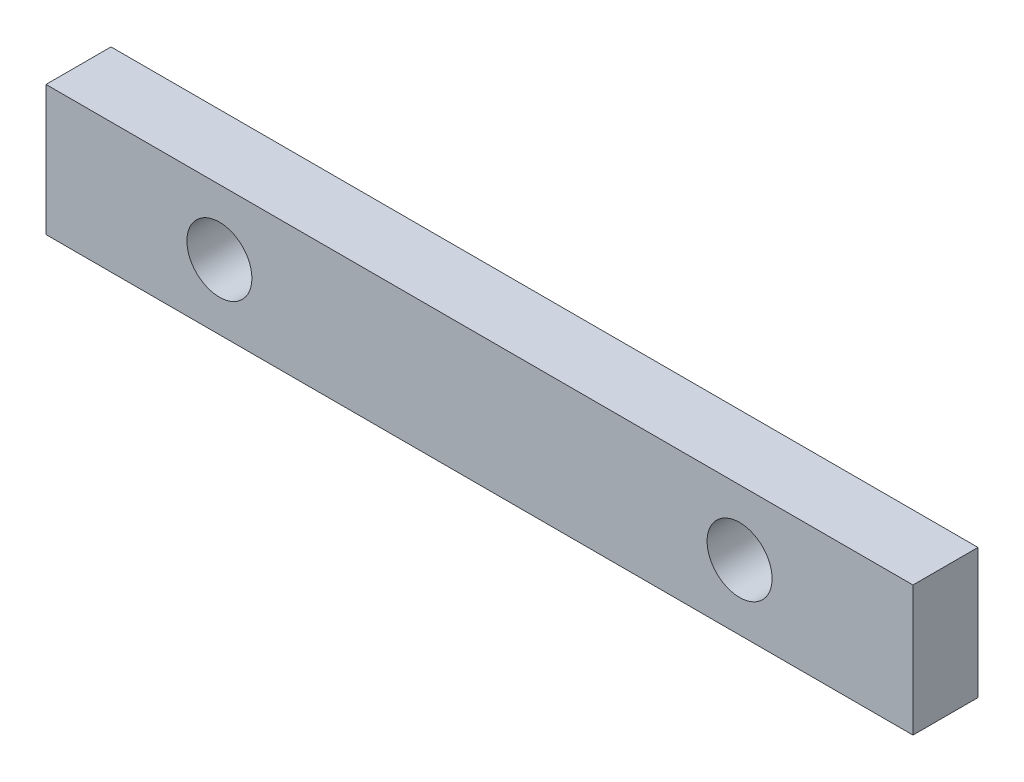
ISO-10303-21;
HEADER;
FILE_DESCRIPTION(('STEP AP214'),'2;1');
FILE_NAME('part.step','',(''),(''),'','','');
FILE_SCHEMA(('AUTOMOTIVE_DESIGN { 1 0 10303 214 1 1 1 1 }'));
ENDSEC;
DATA;
#1=APPLICATION_CONTEXT('core data for automotive mechanical design processes');
#2=APPLICATION_PROTOCOL_DEFINITION('international standard','automotive_design',2000,#1);
#3=PRODUCT_CONTEXT('',#1,'mechanical');
#4=PRODUCT('Part','Part','',(#3));
#5=PRODUCT_RELATED_PRODUCT_CATEGORY('part','',(#4));
#6=PRODUCT_DEFINITION_FORMATION('','',#4);
#7=PRODUCT_DEFINITION_CONTEXT('part definition',#1,'design');
#8=PRODUCT_DEFINITION('design','',#6,#7);
#9=PRODUCT_DEFINITION_SHAPE('','',#8);
#10=(LENGTH_UNIT() NAMED_UNIT(*) SI_UNIT(.MILLI.,.METRE.));
#11=(NAMED_UNIT(*) PLANE_ANGLE_UNIT() SI_UNIT($,.RADIAN.));
#12=(NAMED_UNIT(*) SI_UNIT($,.STERADIAN.) SOLID_ANGLE_UNIT());
#13=UNCERTAINTY_MEASURE_WITH_UNIT(LENGTH_MEASURE(1.E-05),#10,'distance_accuracy_value','');
#14=(GEOMETRIC_REPRESENTATION_CONTEXT(3) GLOBAL_UNCERTAINTY_ASSIGNED_CONTEXT((#13)) GLOBAL_UNIT_ASSIGNED_CONTEXT((#10,
#11,#12)) REPRESENTATION_CONTEXT('',''));
#15=CARTESIAN_POINT('',(0.,0.,0.));
#16=DIRECTION('',(0.,0.,1.));
#17=DIRECTION('',(1.,0.,0.));
#18=AXIS2_PLACEMENT_3D('',#15,#16,#17);
#19=CARTESIAN_POINT('',(0.,0.,3.));
#20=DIRECTION('',(1.,0.,0.));
#21=DIRECTION('',(0.,0.,-1.));
#22=AXIS2_PLACEMENT_3D('',#19,#20,#21);
#23=PLANE('',#22);
#24=DIRECTION('',(0.,-1.,0.));
#25=VECTOR('',#24,1.);
#26=CARTESIAN_POINT('',(0.,0.,0.));
#27=LINE('',#26,#25);
#28=CARTESIAN_POINT('',(0.,6.,0.));
#29=VERTEX_POINT('',#28);
#30=CARTESIAN_POINT('',(0.,0.,0.));
#31=VERTEX_POINT('',#30);
#32=EDGE_CURVE('E70',#29,#31,#27,.T.);
#33=ORIENTED_EDGE('',*,*,#32,.T.);
#34=DIRECTION('',(0.,0.,-1.));
#35=VECTOR('',#34,1.);
#36=CARTESIAN_POINT('',(0.,0.,3.));
#37=LINE('',#36,#35);
#38=CARTESIAN_POINT('',(0.,0.,3.));
#39=VERTEX_POINT('',#38);
#40=EDGE_CURVE('E11',#39,#31,#37,.T.);
#41=ORIENTED_EDGE('',*,*,#40,.F.);
#42=DIRECTION('',(0.,-1.,0.));
#43=VECTOR('',#42,1.);
#44=CARTESIAN_POINT('',(0.,0.,3.));
#45=LINE('',#44,#43);
#46=CARTESIAN_POINT('',(0.,6.,3.));
#47=VERTEX_POINT('',#46);
#48=EDGE_CURVE('E93',#47,#39,#45,.T.);
#49=ORIENTED_EDGE('',*,*,#48,.F.);
#50=DIRECTION('',(0.,0.,-1.));
#51=VECTOR('',#50,1.);
#52=CARTESIAN_POINT('',(0.,6.,3.));
#53=LINE('',#52,#51);
#54=EDGE_CURVE('E82',#47,#29,#53,.T.);
#55=ORIENTED_EDGE('',*,*,#54,.T.);
#56=EDGE_LOOP('',(#33,#41,#49,#55));
#57=FACE_BOUND('',#56,.T.);
#58=ADVANCED_FACE('F26',(#57),#23,.F.);
#59=CARTESIAN_POINT('',(0.,0.,3.));
#60=DIRECTION('',(0.,1.,0.));
#61=DIRECTION('',(0.,0.,1.));
#62=AXIS2_PLACEMENT_3D('',#59,#60,#61);
#63=PLANE('',#62);
#64=DIRECTION('',(1.,0.,0.));
#65=VECTOR('',#64,1.);
#66=CARTESIAN_POINT('',(0.,0.,0.));
#67=LINE('',#66,#65);
#68=CARTESIAN_POINT('',(40.,0.,0.));
#69=VERTEX_POINT('',#68);
#70=EDGE_CURVE('E66',#31,#69,#67,.T.);
#71=ORIENTED_EDGE('',*,*,#70,.T.);
#72=DIRECTION('',(0.,0.,-1.));
#73=VECTOR('',#72,1.);
#74=CARTESIAN_POINT('',(40.,0.,3.));
#75=LINE('',#74,#73);
#76=CARTESIAN_POINT('',(40.,0.,3.));
#77=VERTEX_POINT('',#76);
#78=EDGE_CURVE('E33',#77,#69,#75,.T.);
#79=ORIENTED_EDGE('',*,*,#78,.F.);
#80=DIRECTION('',(1.,0.,0.));
#81=VECTOR('',#80,1.);
#82=CARTESIAN_POINT('',(0.,0.,3.));
#83=LINE('',#82,#81);
#84=EDGE_CURVE('E78',#39,#77,#83,.T.);
#85=ORIENTED_EDGE('',*,*,#84,.F.);
#86=ORIENTED_EDGE('',*,*,#40,.T.);
#87=EDGE_LOOP('',(#71,#79,#85,#86));
#88=FACE_BOUND('',#87,.T.);
#89=ADVANCED_FACE('F77',(#88),#63,.F.);
#90=CARTESIAN_POINT('',(40.,0.,3.));
#91=DIRECTION('',(-1.,0.,0.));
#92=DIRECTION('',(0.,0.,1.));
#93=AXIS2_PLACEMENT_3D('',#90,#91,#92);
#94=PLANE('',#93);
#95=DIRECTION('',(0.,1.,0.));
#96=VECTOR('',#95,1.);
#97=CARTESIAN_POINT('',(40.,0.,0.));
#98=LINE('',#97,#96);
#99=CARTESIAN_POINT('',(40.,6.,0.));
#100=VERTEX_POINT('',#99);
#101=EDGE_CURVE('E71',#69,#100,#98,.T.);
#102=ORIENTED_EDGE('',*,*,#101,.T.);
#103=DIRECTION('',(0.,0.,-1.));
#104=VECTOR('',#103,1.);
#105=CARTESIAN_POINT('',(40.,6.,3.));
#106=LINE('',#105,#104);
#107=CARTESIAN_POINT('',(40.,6.,3.));
#108=VERTEX_POINT('',#107);
#109=EDGE_CURVE('E99',#108,#100,#106,.T.);
#110=ORIENTED_EDGE('',*,*,#109,.F.);
#111=DIRECTION('',(0.,1.,0.));
#112=VECTOR('',#111,1.);
#113=CARTESIAN_POINT('',(40.,0.,3.));
#114=LINE('',#113,#112);
#115=EDGE_CURVE('E45',#77,#108,#114,.T.);
#116=ORIENTED_EDGE('',*,*,#115,.F.);
#117=ORIENTED_EDGE('',*,*,#78,.T.);
#118=EDGE_LOOP('',(#102,#110,#116,#117));
#119=FACE_BOUND('',#118,.T.);
#120=ADVANCED_FACE('F102',(#119),#94,.F.);
#121=CARTESIAN_POINT('',(0.,6.,3.));
#122=DIRECTION('',(0.,-1.,0.));
#123=DIRECTION('',(0.,0.,-1.));
#124=AXIS2_PLACEMENT_3D('',#121,#122,#123);
#125=PLANE('',#124);
#126=DIRECTION('',(-1.,0.,0.));
#127=VECTOR('',#126,1.);
#128=CARTESIAN_POINT('',(0.,6.,0.));
#129=LINE('',#128,#127);
#130=EDGE_CURVE('E91',#100,#29,#129,.T.);
#131=ORIENTED_EDGE('',*,*,#130,.T.);
#132=ORIENTED_EDGE('',*,*,#54,.F.);
#133=DIRECTION('',(-1.,0.,0.));
#134=VECTOR('',#133,1.);
#135=CARTESIAN_POINT('',(0.,6.,3.));
#136=LINE('',#135,#134);
#137=EDGE_CURVE('E40',#108,#47,#136,.T.);
#138=ORIENTED_EDGE('',*,*,#137,.F.);
#139=ORIENTED_EDGE('',*,*,#109,.T.);
#140=EDGE_LOOP('',(#131,#132,#138,#139));
#141=FACE_BOUND('',#140,.T.);
#142=ADVANCED_FACE('F104',(#141),#125,.F.);
#143=CARTESIAN_POINT('',(0.,6.,3.));
#144=DIRECTION('',(0.,0.,-1.));
#145=DIRECTION('',(-1.,0.,0.));
#146=AXIS2_PLACEMENT_3D('',#143,#144,#145);
#147=PLANE('',#146);
#148=CARTESIAN_POINT('',(32.,3.,3.));
#149=DIRECTION('',(0.,0.,1.));
#150=DIRECTION('',(1.,0.,0.));
#151=AXIS2_PLACEMENT_3D('',#148,#149,#150);
#152=CIRCLE('',#151,1.5);
#153=CARTESIAN_POINT('',(33.5,3.,3.));
#154=VERTEX_POINT('',#153);
#155=EDGE_CURVE('E161',#154,#154,#152,.T.);
#156=ORIENTED_EDGE('',*,*,#155,.F.);
#157=EDGE_LOOP('',(#156));
#158=FACE_BOUND('',#157,.T.);
#159=CARTESIAN_POINT('',(8.,3.,3.));
#160=DIRECTION('',(0.,0.,1.));
#161=DIRECTION('',(1.,0.,0.));
#162=AXIS2_PLACEMENT_3D('',#159,#160,#161);
#163=CIRCLE('',#162,1.5);
#164=CARTESIAN_POINT('',(9.5,3.,3.));
#165=VERTEX_POINT('',#164);
#166=EDGE_CURVE('E86',#165,#165,#163,.T.);
#167=ORIENTED_EDGE('',*,*,#166,.F.);
#168=EDGE_LOOP('',(#167));
#169=FACE_BOUND('',#168,.T.);
#170=ORIENTED_EDGE('',*,*,#48,.T.);
#171=ORIENTED_EDGE('',*,*,#84,.T.);
#172=ORIENTED_EDGE('',*,*,#115,.T.);
#173=ORIENTED_EDGE('',*,*,#137,.T.);
#174=EDGE_LOOP('',(#170,#171,#172,#173));
#175=FACE_BOUND('',#174,.T.);
#176=ADVANCED_FACE('F105',(#158,#169,#175),#147,.F.);
#177=CARTESIAN_POINT('',(0.,6.,0.));
#178=DIRECTION('',(0.,0.,-1.));
#179=DIRECTION('',(-1.,0.,0.));
#180=AXIS2_PLACEMENT_3D('',#177,#178,#179);
#181=PLANE('',#180);
#182=CARTESIAN_POINT('',(32.,3.,0.));
#183=DIRECTION('',(0.,0.,1.));
#184=DIRECTION('',(1.,0.,0.));
#185=AXIS2_PLACEMENT_3D('',#182,#183,#184);
#186=CIRCLE('',#185,1.5);
#187=CARTESIAN_POINT('',(33.5,3.,0.));
#188=VERTEX_POINT('',#187);
#189=EDGE_CURVE('E159',#188,#188,#186,.T.);
#190=ORIENTED_EDGE('',*,*,#189,.T.);
#191=EDGE_LOOP('',(#190));
#192=FACE_BOUND('',#191,.T.);
#193=CARTESIAN_POINT('',(8.,3.,0.));
#194=DIRECTION('',(0.,0.,1.));
#195=DIRECTION('',(1.,0.,0.));
#196=AXIS2_PLACEMENT_3D('',#193,#194,#195);
#197=CIRCLE('',#196,1.5);
#198=CARTESIAN_POINT('',(9.5,3.,0.));
#199=VERTEX_POINT('',#198);
#200=EDGE_CURVE('E83',#199,#199,#197,.T.);
#201=ORIENTED_EDGE('',*,*,#200,.T.);
#202=EDGE_LOOP('',(#201));
#203=FACE_BOUND('',#202,.T.);
#204=ORIENTED_EDGE('',*,*,#32,.F.);
#205=ORIENTED_EDGE('',*,*,#130,.F.);
#206=ORIENTED_EDGE('',*,*,#101,.F.);
#207=ORIENTED_EDGE('',*,*,#70,.F.);
#208=EDGE_LOOP('',(#204,#205,#206,#207));
#209=FACE_BOUND('',#208,.T.);
#210=ADVANCED_FACE('F67',(#192,#203,#209),#181,.T.);
#211=CARTESIAN_POINT('',(8.,3.,0.));
#212=DIRECTION('',(0.,0.,1.));
#213=DIRECTION('',(1.,0.,0.));
#214=AXIS2_PLACEMENT_3D('',#211,#212,#213);
#215=CYLINDRICAL_SURFACE('',#214,1.5);
#216=ORIENTED_EDGE('',*,*,#200,.F.);
#217=EDGE_LOOP('',(#216));
#218=FACE_BOUND('',#217,.T.);
#219=ORIENTED_EDGE('',*,*,#166,.T.);
#220=EDGE_LOOP('',(#219));
#221=FACE_BOUND('',#220,.T.);
#222=ADVANCED_FACE('F113',(#218,#221),#215,.F.);
#223=CARTESIAN_POINT('',(32.,3.,0.));
#224=DIRECTION('',(0.,0.,1.));
#225=DIRECTION('',(1.,0.,0.));
#226=AXIS2_PLACEMENT_3D('',#223,#224,#225);
#227=CYLINDRICAL_SURFACE('',#226,1.5);
#228=ORIENTED_EDGE('',*,*,#189,.F.);
#229=EDGE_LOOP('',(#228));
#230=FACE_BOUND('',#229,.T.);
#231=ORIENTED_EDGE('',*,*,#155,.T.);
#232=EDGE_LOOP('',(#231));
#233=FACE_BOUND('',#232,.T.);
#234=ADVANCED_FACE('F146',(#230,#233),#227,.F.);
#235=CLOSED_SHELL('',(#58,#89,#120,#142,#176,#210,#222,#234));
#236=MANIFOLD_SOLID_BREP('B2',#235);
#237=ADVANCED_BREP_SHAPE_REPRESENTATION('',(#18,#236),#14);
#238=SHAPE_DEFINITION_REPRESENTATION(#9,#237);
ENDSEC;
END-ISO-10303-21;
